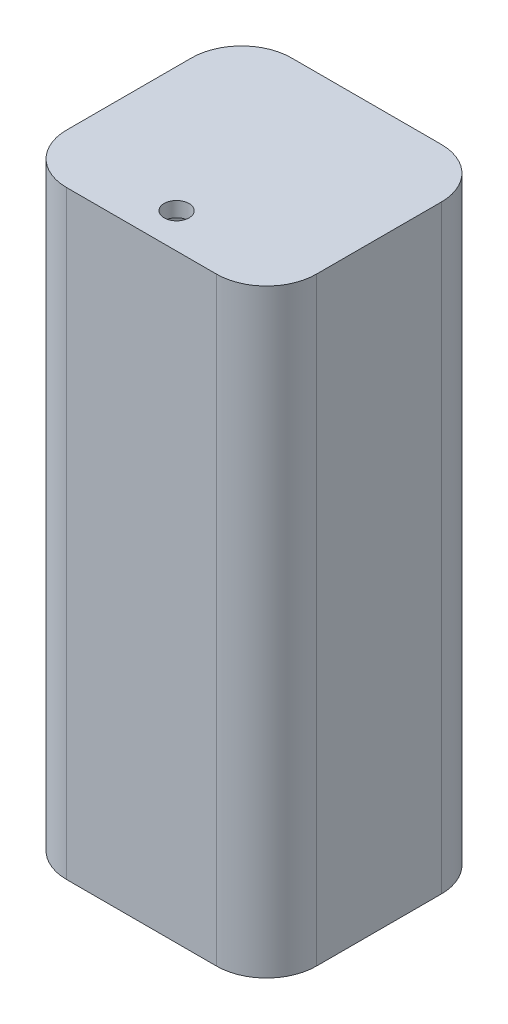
from build123d import *

# Parameters (mm, degrees)
SKETCH2_W           = 50
SKETCH2_H           = 45
BOSS_EXTRUDE1_DEPTH = 120
FILLET1_R           = 10
SHELL1_T            = -3
BOSS_EXTRUDE2_DEPTH = 3
SKETCH3_R           = 2.5
CUT_EXTRUDE2_DEPTH  = 125.624435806


with BuildPart() as part:
    # Sketch2 → Boss-Extrude1 (new body)
    with BuildSketch(Plane(origin=(0, 0, 0), x_dir=(1, 0, 0), z_dir=(0, 1, 0))):
        Rectangle(SKETCH2_W, SKETCH2_H)
    extrude(amount=BOSS_EXTRUDE1_DEPTH)

    # Fillet1
    fillet1_edges = [part.edges().sort_by_distance(p)[0] for p in [
        (25, 60, 22.5),
        (-25, 60, 22.5),
        (-25, 60, -22.5),
        (25, 60, -22.5),
    ]]
    fillet(fillet1_edges, radius=FILLET1_R)

    # Shell1
    shell1_openings = [part.faces().sort_by_distance(p)[0] for p in [
        (0, 120, 0),
    ]]
    offset(amount=SHELL1_T, openings=shell1_openings, kind=Kind.INTERSECTION)

    # Sketch4 → Boss-Extrude2 (add)
    with BuildSketch(Plane(origin=(0, 120, 0), x_dir=(1, 0, 0), z_dir=(0, 1, 0))):
        with BuildLine():
            Line((15, 22.5), (-15, 22.5))
            ThreePointArc((-15, 22.5), (-22.071067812, 19.571067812), (-25, 12.5))
            Line((-25, 12.5), (-25, -12.5))
            ThreePointArc((-25, -12.5), (-22.071067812, -19.571067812), (-15, -22.5))
            Line((-15, -22.5), (15, -22.5))
            ThreePointArc((15, -22.5), (22.071067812, -19.571067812), (25, -12.5))
            Line((25, -12.5), (25, 12.5))
            ThreePointArc((25, 12.5), (22.071067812, 19.571067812), (15, 22.5))
        make_face()
    extrude(amount=-BOSS_EXTRUDE2_DEPTH)

    # Sketch3 → Cut-Extrude2 (cut, through all)
    with BuildSketch(Plane.XZ):
        with Locations(Location((0, 15.5, 0), (0, 0, 270))):
            Circle(SKETCH3_R)
    extrude(amount=-CUT_EXTRUDE2_DEPTH, mode=Mode.SUBTRACT)


solid = part.part
